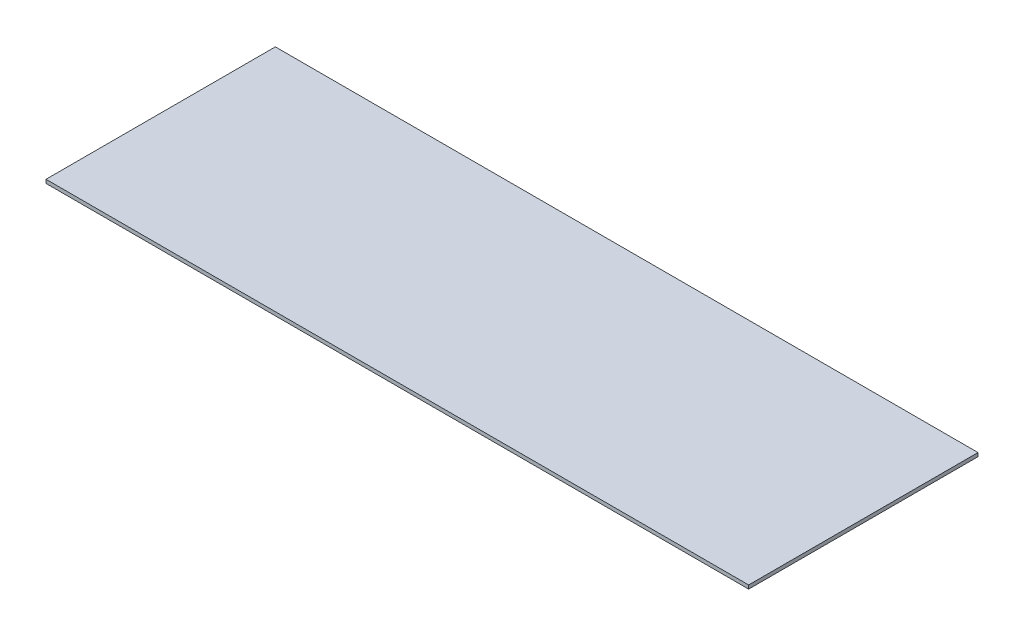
ISO-10303-21;
HEADER;
FILE_DESCRIPTION(('STEP AP214'),'2;1');
FILE_NAME('part.step','',(''),(''),'','','');
FILE_SCHEMA(('AUTOMOTIVE_DESIGN { 1 0 10303 214 1 1 1 1 }'));
ENDSEC;
DATA;
#1=APPLICATION_CONTEXT('core data for automotive mechanical design processes');
#2=APPLICATION_PROTOCOL_DEFINITION('international standard','automotive_design',2000,#1);
#3=PRODUCT_CONTEXT('',#1,'mechanical');
#4=PRODUCT('Part','Part','',(#3));
#5=PRODUCT_RELATED_PRODUCT_CATEGORY('part','',(#4));
#6=PRODUCT_DEFINITION_FORMATION('','',#4);
#7=PRODUCT_DEFINITION_CONTEXT('part definition',#1,'design');
#8=PRODUCT_DEFINITION('design','',#6,#7);
#9=PRODUCT_DEFINITION_SHAPE('','',#8);
#10=(LENGTH_UNIT() NAMED_UNIT(*) SI_UNIT(.MILLI.,.METRE.));
#11=(NAMED_UNIT(*) PLANE_ANGLE_UNIT() SI_UNIT($,.RADIAN.));
#12=(NAMED_UNIT(*) SI_UNIT($,.STERADIAN.) SOLID_ANGLE_UNIT());
#13=UNCERTAINTY_MEASURE_WITH_UNIT(LENGTH_MEASURE(1.E-05),#10,'distance_accuracy_value','');
#14=(GEOMETRIC_REPRESENTATION_CONTEXT(3) GLOBAL_UNCERTAINTY_ASSIGNED_CONTEXT((#13)) GLOBAL_UNIT_ASSIGNED_CONTEXT((#10,
#11,#12)) REPRESENTATION_CONTEXT('',''));
#15=CARTESIAN_POINT('',(0.,0.,0.));
#16=DIRECTION('',(0.,0.,1.));
#17=DIRECTION('',(1.,0.,0.));
#18=AXIS2_PLACEMENT_3D('',#15,#16,#17);
#19=CARTESIAN_POINT('',(457.2,-78.5622,-76.2));
#20=DIRECTION('',(0.,1.,0.));
#21=DIRECTION('',(0.,0.,1.));
#22=AXIS2_PLACEMENT_3D('',#19,#20,#21);
#23=PLANE('',#22);
#24=DIRECTION('',(0.,0.,-1.));
#25=VECTOR('',#24,1.);
#26=CARTESIAN_POINT('',(0.,-78.5622,-76.2));
#27=LINE('',#26,#25);
#28=CARTESIAN_POINT('',(0.,-78.5622,73.025));
#29=VERTEX_POINT('',#28);
#30=CARTESIAN_POINT('',(0.,-78.5622,-76.2));
#31=VERTEX_POINT('',#30);
#32=EDGE_CURVE('E115',#29,#31,#27,.T.);
#33=ORIENTED_EDGE('',*,*,#32,.T.);
#34=DIRECTION('',(-1.,0.,0.));
#35=VECTOR('',#34,1.);
#36=CARTESIAN_POINT('',(457.2,-78.5622,-76.2));
#37=LINE('',#36,#35);
#38=CARTESIAN_POINT('',(457.2,-78.5622,-76.2));
#39=VERTEX_POINT('',#38);
#40=EDGE_CURVE('E11',#39,#31,#37,.T.);
#41=ORIENTED_EDGE('',*,*,#40,.F.);
#42=DIRECTION('',(0.,0.,-1.));
#43=VECTOR('',#42,1.);
#44=CARTESIAN_POINT('',(457.2,-78.5622,-76.2));
#45=LINE('',#44,#43);
#46=CARTESIAN_POINT('',(457.2,-78.5622,73.025));
#47=VERTEX_POINT('',#46);
#48=EDGE_CURVE('E94',#47,#39,#45,.T.);
#49=ORIENTED_EDGE('',*,*,#48,.F.);
#50=DIRECTION('',(-1.,0.,0.));
#51=VECTOR('',#50,1.);
#52=CARTESIAN_POINT('',(457.2,-78.5622,73.025));
#53=LINE('',#52,#51);
#54=EDGE_CURVE('E106',#47,#29,#53,.T.);
#55=ORIENTED_EDGE('',*,*,#54,.T.);
#56=EDGE_LOOP('',(#33,#41,#49,#55));
#57=FACE_BOUND('',#56,.T.);
#58=ADVANCED_FACE('F43',(#57),#23,.F.);
#59=CARTESIAN_POINT('',(457.2,-78.5622,-76.2));
#60=DIRECTION('',(0.,0.,1.));
#61=DIRECTION('',(1.,0.,0.));
#62=AXIS2_PLACEMENT_3D('',#59,#60,#61);
#63=PLANE('',#62);
#64=DIRECTION('',(0.,1.,0.));
#65=VECTOR('',#64,1.);
#66=CARTESIAN_POINT('',(0.,-78.5622,-76.2));
#67=LINE('',#66,#65);
#68=CARTESIAN_POINT('',(0.,-76.2,-76.2));
#69=VERTEX_POINT('',#68);
#70=EDGE_CURVE('E99',#31,#69,#67,.T.);
#71=ORIENTED_EDGE('',*,*,#70,.T.);
#72=DIRECTION('',(-1.,0.,0.));
#73=VECTOR('',#72,1.);
#74=CARTESIAN_POINT('',(457.2,-76.2,-76.2));
#75=LINE('',#74,#73);
#76=CARTESIAN_POINT('',(457.2,-76.2,-76.2));
#77=VERTEX_POINT('',#76);
#78=EDGE_CURVE('E55',#77,#69,#75,.T.);
#79=ORIENTED_EDGE('',*,*,#78,.F.);
#80=DIRECTION('',(0.,1.,0.));
#81=VECTOR('',#80,1.);
#82=CARTESIAN_POINT('',(457.2,-78.5622,-76.2));
#83=LINE('',#82,#81);
#84=EDGE_CURVE('E89',#39,#77,#83,.T.);
#85=ORIENTED_EDGE('',*,*,#84,.F.);
#86=ORIENTED_EDGE('',*,*,#40,.T.);
#87=EDGE_LOOP('',(#71,#79,#85,#86));
#88=FACE_BOUND('',#87,.T.);
#89=ADVANCED_FACE('F98',(#88),#63,.F.);
#90=CARTESIAN_POINT('',(457.2,-76.2,-76.2));
#91=DIRECTION('',(0.,-1.,0.));
#92=DIRECTION('',(0.,0.,-1.));
#93=AXIS2_PLACEMENT_3D('',#90,#91,#92);
#94=PLANE('',#93);
#95=DIRECTION('',(0.,0.,1.));
#96=VECTOR('',#95,1.);
#97=CARTESIAN_POINT('',(0.,-76.2,-76.2));
#98=LINE('',#97,#96);
#99=CARTESIAN_POINT('',(0.,-76.2,73.025));
#100=VERTEX_POINT('',#99);
#101=EDGE_CURVE('E77',#69,#100,#98,.T.);
#102=ORIENTED_EDGE('',*,*,#101,.T.);
#103=DIRECTION('',(-1.,0.,0.));
#104=VECTOR('',#103,1.);
#105=CARTESIAN_POINT('',(457.2,-76.2,73.025));
#106=LINE('',#105,#104);
#107=CARTESIAN_POINT('',(457.2,-76.2,73.025));
#108=VERTEX_POINT('',#107);
#109=EDGE_CURVE('E105',#108,#100,#106,.T.);
#110=ORIENTED_EDGE('',*,*,#109,.F.);
#111=DIRECTION('',(0.,0.,1.));
#112=VECTOR('',#111,1.);
#113=CARTESIAN_POINT('',(457.2,-76.2,-76.2));
#114=LINE('',#113,#112);
#115=EDGE_CURVE('E93',#77,#108,#114,.T.);
#116=ORIENTED_EDGE('',*,*,#115,.F.);
#117=ORIENTED_EDGE('',*,*,#78,.T.);
#118=EDGE_LOOP('',(#102,#110,#116,#117));
#119=FACE_BOUND('',#118,.T.);
#120=ADVANCED_FACE('F104',(#119),#94,.F.);
#121=CARTESIAN_POINT('',(457.2,-78.5622,73.025));
#122=DIRECTION('',(0.,0.,-1.));
#123=DIRECTION('',(-1.,0.,0.));
#124=AXIS2_PLACEMENT_3D('',#121,#122,#123);
#125=PLANE('',#124);
#126=DIRECTION('',(0.,-1.,0.));
#127=VECTOR('',#126,1.);
#128=CARTESIAN_POINT('',(0.,-78.5622,73.025));
#129=LINE('',#128,#127);
#130=EDGE_CURVE('E81',#100,#29,#129,.T.);
#131=ORIENTED_EDGE('',*,*,#130,.T.);
#132=ORIENTED_EDGE('',*,*,#54,.F.);
#133=DIRECTION('',(0.,-1.,0.));
#134=VECTOR('',#133,1.);
#135=CARTESIAN_POINT('',(457.2,-78.5622,73.025));
#136=LINE('',#135,#134);
#137=EDGE_CURVE('E58',#108,#47,#136,.T.);
#138=ORIENTED_EDGE('',*,*,#137,.F.);
#139=ORIENTED_EDGE('',*,*,#109,.T.);
#140=EDGE_LOOP('',(#131,#132,#138,#139));
#141=FACE_BOUND('',#140,.T.);
#142=ADVANCED_FACE('F128',(#141),#125,.F.);
#143=CARTESIAN_POINT('',(457.2,0.,0.));
#144=DIRECTION('',(-1.,0.,0.));
#145=DIRECTION('',(0.,0.,1.));
#146=AXIS2_PLACEMENT_3D('',#143,#144,#145);
#147=PLANE('',#146);
#148=ORIENTED_EDGE('',*,*,#48,.T.);
#149=ORIENTED_EDGE('',*,*,#84,.T.);
#150=ORIENTED_EDGE('',*,*,#115,.T.);
#151=ORIENTED_EDGE('',*,*,#137,.T.);
#152=EDGE_LOOP('',(#148,#149,#150,#151));
#153=FACE_BOUND('',#152,.T.);
#154=ADVANCED_FACE('F91',(#153),#147,.F.);
#155=CARTESIAN_POINT('',(0.,0.,0.));
#156=DIRECTION('',(-1.,0.,0.));
#157=DIRECTION('',(0.,0.,1.));
#158=AXIS2_PLACEMENT_3D('',#155,#156,#157);
#159=PLANE('',#158);
#160=ORIENTED_EDGE('',*,*,#32,.F.);
#161=ORIENTED_EDGE('',*,*,#130,.F.);
#162=ORIENTED_EDGE('',*,*,#101,.F.);
#163=ORIENTED_EDGE('',*,*,#70,.F.);
#164=EDGE_LOOP('',(#160,#161,#162,#163));
#165=FACE_BOUND('',#164,.T.);
#166=ADVANCED_FACE('F129',(#165),#159,.T.);
#167=CLOSED_SHELL('',(#58,#89,#120,#142,#154,#166));
#168=MANIFOLD_SOLID_BREP('B2',#167);
#169=ADVANCED_BREP_SHAPE_REPRESENTATION('',(#18,#168),#14);
#170=SHAPE_DEFINITION_REPRESENTATION(#9,#169);
ENDSEC;
END-ISO-10303-21;
